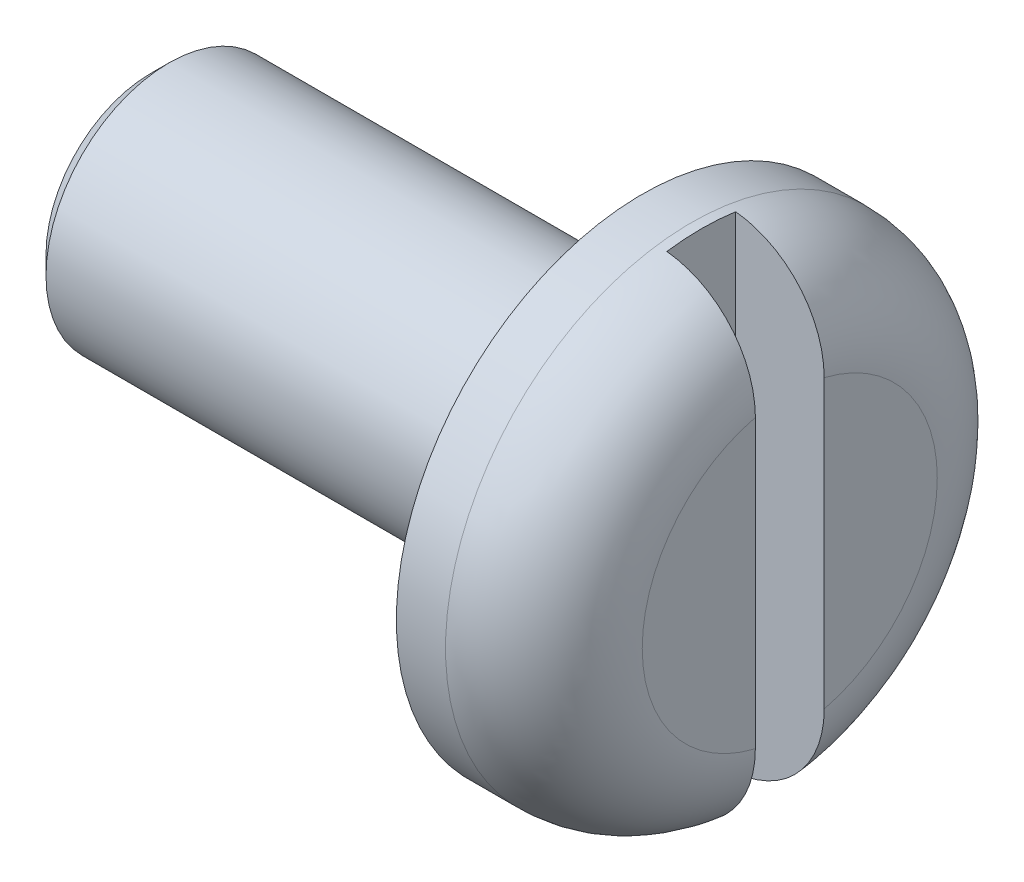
ISO-10303-21;
HEADER;
FILE_DESCRIPTION(('STEP AP214'),'2;1');
FILE_NAME('part.step','',(''),(''),'','','');
FILE_SCHEMA(('AUTOMOTIVE_DESIGN { 1 0 10303 214 1 1 1 1 }'));
ENDSEC;
DATA;
#1=APPLICATION_CONTEXT('core data for automotive mechanical design processes');
#2=APPLICATION_PROTOCOL_DEFINITION('international standard','automotive_design',2000,#1);
#3=PRODUCT_CONTEXT('',#1,'mechanical');
#4=PRODUCT('Part','Part','',(#3));
#5=PRODUCT_RELATED_PRODUCT_CATEGORY('part','',(#4));
#6=PRODUCT_DEFINITION_FORMATION('','',#4);
#7=PRODUCT_DEFINITION_CONTEXT('part definition',#1,'design');
#8=PRODUCT_DEFINITION('design','',#6,#7);
#9=PRODUCT_DEFINITION_SHAPE('','',#8);
#10=(LENGTH_UNIT() NAMED_UNIT(*) SI_UNIT(.MILLI.,.METRE.));
#11=(NAMED_UNIT(*) PLANE_ANGLE_UNIT() SI_UNIT($,.RADIAN.));
#12=(NAMED_UNIT(*) SI_UNIT($,.STERADIAN.) SOLID_ANGLE_UNIT());
#13=UNCERTAINTY_MEASURE_WITH_UNIT(LENGTH_MEASURE(1.E-05),#10,'distance_accuracy_value','');
#14=(GEOMETRIC_REPRESENTATION_CONTEXT(3) GLOBAL_UNCERTAINTY_ASSIGNED_CONTEXT((#13)) GLOBAL_UNIT_ASSIGNED_CONTEXT((#10,
#11,#12)) REPRESENTATION_CONTEXT('',''));
#15=CARTESIAN_POINT('',(0.,0.,0.));
#16=DIRECTION('',(0.,0.,1.));
#17=DIRECTION('',(1.,0.,0.));
#18=AXIS2_PLACEMENT_3D('',#15,#16,#17);
#19=CARTESIAN_POINT('',(-20.,0.,0.));
#20=DIRECTION('',(1.,0.,0.));
#21=DIRECTION('',(0.,0.,-1.));
#22=AXIS2_PLACEMENT_3D('',#19,#20,#21);
#23=CYLINDRICAL_SURFACE('',#22,5.);
#24=CARTESIAN_POINT('',(0.,0.,0.));
#25=DIRECTION('',(1.,0.,0.));
#26=DIRECTION('',(0.,0.,-1.));
#27=AXIS2_PLACEMENT_3D('',#24,#25,#26);
#28=CIRCLE('',#27,5.);
#29=CARTESIAN_POINT('',(0.,0.,-5.));
#30=VERTEX_POINT('',#29);
#31=EDGE_CURVE('E13',#30,#30,#28,.F.);
#32=ORIENTED_EDGE('',*,*,#31,.T.);
#33=EDGE_LOOP('',(#32));
#34=FACE_BOUND('',#33,.T.);
#35=CARTESIAN_POINT('',(-19.25,0.,0.));
#36=DIRECTION('',(1.,0.,0.));
#37=DIRECTION('',(0.,0.,-1.));
#38=AXIS2_PLACEMENT_3D('',#35,#36,#37);
#39=CIRCLE('',#38,5.);
#40=CARTESIAN_POINT('',(-19.25,0.,-5.));
#41=VERTEX_POINT('',#40);
#42=EDGE_CURVE('E229',#41,#41,#39,.F.);
#43=ORIENTED_EDGE('',*,*,#42,.F.);
#44=EDGE_LOOP('',(#43));
#45=FACE_BOUND('',#44,.T.);
#46=ADVANCED_FACE('F172',(#34,#45),#23,.T.);
#47=CARTESIAN_POINT('',(6.,0.,0.));
#48=DIRECTION('',(1.,0.,0.));
#49=DIRECTION('',(0.,0.,-1.));
#50=AXIS2_PLACEMENT_3D('',#47,#48,#49);
#51=PLANE('',#50);
#52=DIRECTION('',(0.,-1.,0.));
#53=VECTOR('',#52,1.);
#54=CARTESIAN_POINT('',(6.,11.1539479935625,1.4));
#55=LINE('',#54,#53);
#56=CARTESIAN_POINT('',(6.,5.83438085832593,1.4));
#57=VERTEX_POINT('',#56);
#58=CARTESIAN_POINT('',(6.,-5.83438085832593,1.4));
#59=VERTEX_POINT('',#58);
#60=EDGE_CURVE('E216',#57,#59,#55,.T.);
#61=ORIENTED_EDGE('',*,*,#60,.F.);
#62=CARTESIAN_POINT('',(6.,0.,0.));
#63=DIRECTION('',(1.,0.,0.));
#64=DIRECTION('',(0.,0.,-1.));
#65=AXIS2_PLACEMENT_3D('',#62,#63,#64);
#66=CIRCLE('',#65,6.);
#67=EDGE_CURVE('E227',#57,#59,#66,.T.);
#68=ORIENTED_EDGE('',*,*,#67,.T.);
#69=EDGE_LOOP('',(#61,#68));
#70=FACE_BOUND('',#69,.T.);
#71=ADVANCED_FACE('F226',(#70),#51,.T.);
#72=CARTESIAN_POINT('',(6.,0.,0.));
#73=DIRECTION('',(-1.,0.,0.));
#74=DIRECTION('',(0.,0.,1.));
#75=AXIS2_PLACEMENT_3D('',#72,#73,#74);
#76=CYLINDRICAL_SURFACE('',#75,10.);
#77=CARTESIAN_POINT('',(2.,0.,0.));
#78=DIRECTION('',(1.,0.,0.));
#79=DIRECTION('',(0.,0.,-1.));
#80=AXIS2_PLACEMENT_3D('',#77,#78,#79);
#81=CIRCLE('',#80,10.);
#82=CARTESIAN_POINT('',(2.,0.,-10.));
#83=VERTEX_POINT('',#82);
#84=EDGE_CURVE('E232',#83,#83,#81,.F.);
#85=ORIENTED_EDGE('',*,*,#84,.T.);
#86=EDGE_LOOP('',(#85));
#87=FACE_BOUND('',#86,.T.);
#88=CARTESIAN_POINT('',(0.,0.,0.));
#89=DIRECTION('',(1.,0.,0.));
#90=DIRECTION('',(0.,0.,-1.));
#91=AXIS2_PLACEMENT_3D('',#88,#89,#90);
#92=CIRCLE('',#91,10.);
#93=CARTESIAN_POINT('',(0.,0.,-10.));
#94=VERTEX_POINT('',#93);
#95=EDGE_CURVE('E239',#94,#94,#92,.T.);
#96=ORIENTED_EDGE('',*,*,#95,.T.);
#97=EDGE_LOOP('',(#96));
#98=FACE_BOUND('',#97,.T.);
#99=ADVANCED_FACE('F294',(#87,#98),#76,.T.);
#100=DIRECTION('',(0.,1.,0.));
#101=VECTOR('',#100,1.);
#102=CARTESIAN_POINT('',(6.,11.1539479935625,-1.4));
#103=LINE('',#102,#101);
#104=CARTESIAN_POINT('',(6.,-5.83438085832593,-1.4));
#105=VERTEX_POINT('',#104);
#106=CARTESIAN_POINT('',(6.,5.83438085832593,-1.4));
#107=VERTEX_POINT('',#106);
#108=EDGE_CURVE('E228',#105,#107,#103,.T.);
#109=ORIENTED_EDGE('',*,*,#108,.F.);
#110=EDGE_CURVE('E233',#105,#107,#66,.T.);
#111=ORIENTED_EDGE('',*,*,#110,.T.);
#112=EDGE_LOOP('',(#109,#111));
#113=FACE_BOUND('',#112,.T.);
#114=ADVANCED_FACE('F272',(#113),#51,.T.);
#115=CARTESIAN_POINT('',(0.,0.,0.));
#116=DIRECTION('',(1.,0.,0.));
#117=DIRECTION('',(0.,0.,-1.));
#118=AXIS2_PLACEMENT_3D('',#115,#116,#117);
#119=PLANE('',#118);
#120=ORIENTED_EDGE('',*,*,#31,.F.);
#121=EDGE_LOOP('',(#120));
#122=FACE_BOUND('',#121,.T.);
#123=ORIENTED_EDGE('',*,*,#95,.F.);
#124=EDGE_LOOP('',(#123));
#125=FACE_BOUND('',#124,.T.);
#126=ADVANCED_FACE('F325',(#122,#125),#119,.F.);
#127=CARTESIAN_POINT('',(2.,0.,0.));
#128=DIRECTION('',(1.,0.,0.));
#129=DIRECTION('',(0.,0.,-1.));
#130=AXIS2_PLACEMENT_3D('',#127,#128,#129);
#131=TOROIDAL_SURFACE('',#130,6.,4.);
#132=CARTESIAN_POINT('',(4.44187177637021,-9.06064172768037,1.4));
#133=CARTESIAN_POINT('',(4.26587430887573,-9.19788561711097,1.4));
#134=CARTESIAN_POINT('',(4.0781887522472,-9.32046512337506,1.4));
#135=CARTESIAN_POINT('',(3.68473930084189,-9.53251573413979,1.4));
#136=CARTESIAN_POINT('',(3.47895146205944,-9.62194214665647,1.4));
#137=CARTESIAN_POINT('',(3.05531205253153,-9.76488678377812,1.4));
#138=CARTESIAN_POINT('',(2.83746477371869,-9.81841769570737,1.4));
#139=CARTESIAN_POINT('',(2.3959323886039,-9.88800523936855,1.4));
#140=CARTESIAN_POINT('',(2.17224896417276,-9.90407254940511,1.4));
#141=CARTESIAN_POINT('',(1.72599843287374,-9.89830398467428,1.4));
#142=CARTESIAN_POINT('',(1.50342995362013,-9.87657400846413,1.4));
#143=CARTESIAN_POINT('',(1.06509554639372,-9.79605156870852,1.4));
#144=CARTESIAN_POINT('',(0.84932985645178,-9.73725780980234,1.4));
#145=CARTESIAN_POINT('',(0.430717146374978,-9.58433496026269,1.4));
#146=CARTESIAN_POINT('',(0.227869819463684,-9.4902067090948,1.4));
#147=CARTESIAN_POINT('',(-0.15922837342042,-9.26936689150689,1.4));
#148=CARTESIAN_POINT('',(-0.343479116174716,-9.14265510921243,1.4));
#149=CARTESIAN_POINT('',(-0.689029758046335,-8.8597278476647,1.4));
#150=CARTESIAN_POINT('',(-0.850229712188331,-8.7033903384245,1.4));
#151=CARTESIAN_POINT('',(-1.14437996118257,-8.36609286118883,1.4));
#152=CARTESIAN_POINT('',(-1.27732943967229,-8.18513218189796,1.4));
#153=CARTESIAN_POINT('',(-1.51261788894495,-7.80196170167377,1.4));
#154=CARTESIAN_POINT('',(-1.61465821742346,-7.59956860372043,1.4));
#155=CARTESIAN_POINT('',(-1.78392595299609,-7.18073257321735,1.4));
#156=CARTESIAN_POINT('',(-1.851151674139,-6.96428896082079,1.4));
#157=CARTESIAN_POINT('',(-1.95022439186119,-6.51965702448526,1.4));
#158=CARTESIAN_POINT('',(-1.98146031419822,-6.29133274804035,1.4));
#159=CARTESIAN_POINT('',(-2.00625779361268,-5.83266619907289,1.4));
#160=CARTESIAN_POINT('',(-1.99981460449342,-5.60232367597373,1.4));
#161=CARTESIAN_POINT('',(-1.9494549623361,-5.13920610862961,1.4));
#162=CARTESIAN_POINT('',(-1.90448529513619,-4.90654609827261,1.4));
#163=CARTESIAN_POINT('',(-1.77783498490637,-4.4515119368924,1.4));
#164=CARTESIAN_POINT('',(-1.6961526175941,-4.22913826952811,1.4));
#165=CARTESIAN_POINT('',(-1.49468677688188,-3.7901072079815,1.4));
#166=CARTESIAN_POINT('',(-1.37334388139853,-3.57416598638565,1.4));
#167=CARTESIAN_POINT('',(-1.09813237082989,-3.16404131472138,1.4));
#168=CARTESIAN_POINT('',(-0.944239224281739,-2.9698744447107,1.4));
#169=CARTESIAN_POINT('',(-0.597827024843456,-2.59615466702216,1.4));
#170=CARTESIAN_POINT('',(-0.403501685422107,-2.41826024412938,1.4));
#171=CARTESIAN_POINT('',(-0.092077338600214,-2.17758669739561,1.4));
#172=CARTESIAN_POINT('',(0.0151196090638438,-2.10168811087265,1.4));
#173=CARTESIAN_POINT('',(0.23574851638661,-1.95952195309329,1.4));
#174=CARTESIAN_POINT('',(0.349178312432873,-1.89325106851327,1.4));
#175=CARTESIAN_POINT('',(0.548659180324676,-1.7889672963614,1.4));
#176=CARTESIAN_POINT('',(0.63332024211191,-1.74827853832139,1.4));
#177=CARTESIAN_POINT('',(0.805407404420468,-1.67312945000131,1.4));
#178=CARTESIAN_POINT('',(0.892834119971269,-1.63867051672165,1.4));
#179=CARTESIAN_POINT('',(1.06991654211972,-1.57684435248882,1.4));
#180=CARTESIAN_POINT('',(1.15956573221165,-1.54945858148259,1.4));
#181=CARTESIAN_POINT('',(1.3408549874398,-1.50251309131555,1.4));
#182=CARTESIAN_POINT('',(1.43249386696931,-1.48294883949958,1.4));
#183=CARTESIAN_POINT('',(1.61825060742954,-1.4522400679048,1.4));
#184=CARTESIAN_POINT('',(1.71238475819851,-1.44119273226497,1.4));
#185=CARTESIAN_POINT('',(1.90128139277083,-1.42843400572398,1.4));
#186=CARTESIAN_POINT('',(1.99604381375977,-1.42672169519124,1.4));
#187=CARTESIAN_POINT('',(2.18534284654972,-1.432728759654,1.4));
#188=CARTESIAN_POINT('',(2.27987923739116,-1.44045516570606,1.4));
#189=CARTESIAN_POINT('',(2.46774805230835,-1.46493842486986,1.4));
#190=CARTESIAN_POINT('',(2.56108025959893,-1.48169688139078,1.4));
#191=CARTESIAN_POINT('',(2.85382362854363,-1.54796841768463,1.4));
#192=CARTESIAN_POINT('',(3.04990809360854,-1.61288226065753,1.4));
#193=CARTESIAN_POINT('',(3.33406189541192,-1.73299533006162,1.4));
#194=CARTESIAN_POINT('',(3.42727079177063,-1.77691954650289,1.4));
#195=CARTESIAN_POINT('',(3.61021636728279,-1.871573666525,1.4));
#196=CARTESIAN_POINT('',(3.69995278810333,-1.92230407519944,1.4));
#197=CARTESIAN_POINT('',(3.90017272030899,-2.04489804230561,1.4));
#198=CARTESIAN_POINT('',(4.00946392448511,-2.11870992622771,1.4));
#199=CARTESIAN_POINT('',(4.22139398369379,-2.2753050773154,1.4));
#200=CARTESIAN_POINT('',(4.32403139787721,-2.35809027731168,1.4));
#201=CARTESIAN_POINT('',(4.62096616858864,-2.61860205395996,1.4));
#202=CARTESIAN_POINT('',(4.80463515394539,-2.80870164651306,1.4));
#203=CARTESIAN_POINT('',(5.13874103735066,-3.21755005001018,1.4));
#204=CARTESIAN_POINT('',(5.28903783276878,-3.43641372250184,1.4));
#205=CARTESIAN_POINT('',(5.48466407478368,-3.78137683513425,1.4));
#206=CARTESIAN_POINT('',(5.54492425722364,-3.89920166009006,1.4));
#207=CARTESIAN_POINT('',(5.65490619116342,-4.13965275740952,1.4));
#208=CARTESIAN_POINT('',(5.70463228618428,-4.26227702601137,1.4));
#209=CARTESIAN_POINT('',(5.79220924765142,-4.50928577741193,1.4));
#210=CARTESIAN_POINT('',(5.83025200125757,-4.63360232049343,1.4));
#211=CARTESIAN_POINT('',(5.89514340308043,-4.88507488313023,1.4));
#212=CARTESIAN_POINT('',(5.92199682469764,-5.01222966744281,1.4));
#213=CARTESIAN_POINT('',(5.96415481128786,-5.26844608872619,1.4));
#214=CARTESIAN_POINT('',(5.97945909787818,-5.39750777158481,1.4));
#215=CARTESIAN_POINT('',(5.99824198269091,-5.65648556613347,1.4));
#216=CARTESIAN_POINT('',(6.00172152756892,-5.78640160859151,1.4));
#217=CARTESIAN_POINT('',(5.99684839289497,-6.03805873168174,1.4));
#218=CARTESIAN_POINT('',(5.98920621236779,-6.15981393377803,1.4));
#219=CARTESIAN_POINT('',(5.96331711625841,-6.40218796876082,1.4));
#220=CARTESIAN_POINT('',(5.94507095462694,-6.52280688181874,1.4));
#221=CARTESIAN_POINT('',(5.89801976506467,-6.76200813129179,1.4));
#222=CARTESIAN_POINT('',(5.86921144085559,-6.88058981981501,1.4));
#223=CARTESIAN_POINT('',(5.80119935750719,-7.11468294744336,1.4));
#224=CARTESIAN_POINT('',(5.76200002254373,-7.23019567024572,1.4));
#225=CARTESIAN_POINT('',(5.67525089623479,-7.45263639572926,1.4));
#226=CARTESIAN_POINT('',(5.6281059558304,-7.55972244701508,1.4));
#227=CARTESIAN_POINT('',(5.5247923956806,-7.7693959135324,1.4));
#228=CARTESIAN_POINT('',(5.46862760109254,-7.87198521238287,1.4));
#229=CARTESIAN_POINT('',(5.34771088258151,-8.07180138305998,1.4));
#230=CARTESIAN_POINT('',(5.28296963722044,-8.16903471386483,1.4));
#231=CARTESIAN_POINT('',(5.14532643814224,-8.35748732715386,1.4));
#232=CARTESIAN_POINT('',(5.07242724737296,-8.44870862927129,1.4));
#233=CARTESIAN_POINT('',(4.91198340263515,-8.63245739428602,1.4));
#234=CARTESIAN_POINT('',(4.82370993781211,-8.72435103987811,1.4));
#235=CARTESIAN_POINT('',(4.63884919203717,-8.89930077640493,1.4));
#236=CARTESIAN_POINT('',(4.54226192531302,-8.98235688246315,1.4));
#237=CARTESIAN_POINT('',(4.44187177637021,-9.06064172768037,1.4));
#238=B_SPLINE_CURVE_WITH_KNOTS('',3,(#132,#133,#134,#135,#136,#137,#138,#139,#140,#141,#142,
#143,#144,#145,#146,#147,#148,#149,#150,#151,#152,#153,#154,#155,#156,#157,#158,#159,#160,#161,
#162,#163,#164,#165,#166,#167,#168,#169,#170,#171,#172,#173,#174,#175,#176,#177,#178,#179,#180,
#181,#182,#183,#184,#185,#186,#187,#188,#189,#190,#191,#192,#193,#194,#195,#196,#197,#198,#199,
#200,#201,#202,#203,#204,#205,#206,#207,#208,#209,#210,#211,#212,#213,#214,#215,#216,#217,#218,
#219,#220,#221,#222,#223,#224,#225,#226,#227,#228,#229,#230,#231,#232,#233,#234,#235,#236,#237),
.UNSPECIFIED.,.T.,.F.,(4,2,2,2,2,2,2,2,2,2,2,2,2,2,2,2,2,2,2,2,2,2,2,2,2,2,2,2,2,2,2,2,2,2,2,2,
2,2,2,2,2,2,2,2,2,2,2,2,2,2,2,2,4),(0.,0.669105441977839,1.3391096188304,2.00887685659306,
2.67845316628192,3.34615651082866,4.01388319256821,4.68159401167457,5.3493092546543,
6.01983711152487,6.69038434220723,7.36721762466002,8.04408368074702,8.73228040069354,
9.42056381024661,10.1282863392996,10.8360421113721,11.5758836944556,12.3162848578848,
13.1027064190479,13.4963615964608,13.889880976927,14.1714629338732,14.4531079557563,
14.7340070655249,15.0147431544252,15.298637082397,15.5825030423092,15.866580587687,
16.1507085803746,16.7664463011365,17.0753898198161,17.384356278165,17.7794777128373,
18.1746844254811,18.9638801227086,19.7563288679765,20.1529254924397,20.5493582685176,
20.9388808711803,21.3282371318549,21.7176027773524,22.1069372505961,22.4724649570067,
22.8379666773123,23.2035825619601,23.5690430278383,23.9196275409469,24.2700637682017,
24.6200676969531,24.969953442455,25.351616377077,25.7332786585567),.UNSPECIFIED.);
#239=CARTESIAN_POINT('',(2.4,-9.88126494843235,1.4));
#240=VERTEX_POINT('',#239);
#241=EDGE_CURVE('E181',#59,#240,#238,.T.);
#242=ORIENTED_EDGE('',*,*,#241,.F.);
#243=ORIENTED_EDGE('',*,*,#67,.F.);
#244=CARTESIAN_POINT('',(2.71643912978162,1.51753697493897,1.4));
#245=CARTESIAN_POINT('',(2.57258810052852,1.48192838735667,1.4));
#246=CARTESIAN_POINT('',(2.42625150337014,1.45625343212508,1.4));
#247=CARTESIAN_POINT('',(2.20520382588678,1.43470004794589,1.4));
#248=CARTESIAN_POINT('',(2.13127260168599,1.43034162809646,1.4));
#249=CARTESIAN_POINT('',(1.98330271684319,1.42737857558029,1.4));
#250=CARTESIAN_POINT('',(1.90926408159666,1.42877275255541,1.4));
#251=CARTESIAN_POINT('',(1.7525531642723,1.43779670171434,1.4));
#252=CARTESIAN_POINT('',(1.66992254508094,1.44616204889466,1.4));
#253=CARTESIAN_POINT('',(1.5056657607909,1.46975091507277,1.4));
#254=CARTESIAN_POINT('',(1.42403969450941,1.48497510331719,1.4));
#255=CARTESIAN_POINT('',(1.18100193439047,1.54027095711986,1.4));
#256=CARTESIAN_POINT('',(1.02170255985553,1.58994756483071,1.4));
#257=CARTESIAN_POINT('',(0.756434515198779,1.69271032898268,1.4));
#258=CARTESIAN_POINT('',(0.648374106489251,1.74064884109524,1.4));
#259=CARTESIAN_POINT('',(0.436744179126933,1.84570179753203,1.4));
#260=CARTESIAN_POINT('',(0.333176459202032,1.90281987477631,1.4));
#261=CARTESIAN_POINT('',(0.130875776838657,2.02522875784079,1.4));
#262=CARTESIAN_POINT('',(0.0321475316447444,2.09052732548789,1.4));
#263=CARTESIAN_POINT('',(-0.159988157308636,2.22845633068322,1.4));
#264=CARTESIAN_POINT('',(-0.25339625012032,2.30108587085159,1.4));
#265=CARTESIAN_POINT('',(-0.52903379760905,2.5324210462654,1.4));
#266=CARTESIAN_POINT('',(-0.702377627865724,2.70194812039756,1.4));
#267=CARTESIAN_POINT('',(-1.0213106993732,3.06503434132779,1.4));
#268=CARTESIAN_POINT('',(-1.16691695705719,3.25857863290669,1.4));
#269=CARTESIAN_POINT('',(-1.44035389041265,3.6878425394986,1.4));
#270=CARTESIAN_POINT('',(-1.56461785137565,3.9258589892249,1.4));
#271=CARTESIAN_POINT('',(-1.76894969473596,4.42030041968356,1.4));
#272=CARTESIAN_POINT('',(-1.84900941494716,4.67672879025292,1.4));
#273=CARTESIAN_POINT('',(-1.95788537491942,5.18637041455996,1.4));
#274=CARTESIAN_POINT('',(-1.98914361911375,5.43906084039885,1.4));
#275=CARTESIAN_POINT('',(-2.00610343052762,5.94595598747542,1.4));
#276=CARTESIAN_POINT('',(-1.99182327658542,6.20016006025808,1.4));
#277=CARTESIAN_POINT('',(-1.91940113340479,6.68776313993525,1.4));
#278=CARTESIAN_POINT('',(-1.8637441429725,6.92153272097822,1.4));
#279=CARTESIAN_POINT('',(-1.71256898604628,7.37581542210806,1.4));
#280=CARTESIAN_POINT('',(-1.61705890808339,7.5963312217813,1.4));
#281=CARTESIAN_POINT('',(-1.3926483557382,8.00987085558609,1.4));
#282=CARTESIAN_POINT('',(-1.26500699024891,8.20357867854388,1.4));
#283=CARTESIAN_POINT('',(-0.978408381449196,8.56625107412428,1.4));
#284=CARTESIAN_POINT('',(-0.819454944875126,8.73521865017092,1.4));
#285=CARTESIAN_POINT('',(-0.478182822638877,9.04018861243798,1.4));
#286=CARTESIAN_POINT('',(-0.296383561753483,9.17677256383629,1.4));
#287=CARTESIAN_POINT('',(0.0877700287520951,9.41708398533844,1.4));
#288=CARTESIAN_POINT('',(0.290122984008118,9.52081365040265,1.4));
#289=CARTESIAN_POINT('',(0.707259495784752,9.69136066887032,1.4));
#290=CARTESIAN_POINT('',(0.921884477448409,9.75856606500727,1.4));
#291=CARTESIAN_POINT('',(1.35939830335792,9.85578285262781,1.4));
#292=CARTESIAN_POINT('',(1.5822868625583,9.88579552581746,1.4));
#293=CARTESIAN_POINT('',(2.02877738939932,9.9076804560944,1.4));
#294=CARTESIAN_POINT('',(2.2523698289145,9.89974761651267,1.4));
#295=CARTESIAN_POINT('',(2.69503967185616,9.84642376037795,1.4));
#296=CARTESIAN_POINT('',(2.91411713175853,9.80103321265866,1.4));
#297=CARTESIAN_POINT('',(3.34138139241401,9.67417742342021,1.4));
#298=CARTESIAN_POINT('',(3.54957627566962,9.59273939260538,1.4));
#299=CARTESIAN_POINT('',(3.94940049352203,9.39617954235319,1.4));
#300=CARTESIAN_POINT('',(4.14102973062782,9.2810575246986,1.4));
#301=CARTESIAN_POINT('',(4.50302006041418,9.020033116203,1.4));
#302=CARTESIAN_POINT('',(4.67330664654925,8.87402742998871,1.4));
#303=CARTESIAN_POINT('',(4.98719061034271,8.55571107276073,1.4));
#304=CARTESIAN_POINT('',(5.13078728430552,8.38339970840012,1.4));
#305=CARTESIAN_POINT('',(5.38856294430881,8.01588437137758,1.4));
#306=CARTESIAN_POINT('',(5.50248766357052,7.82050212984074,1.4));
#307=CARTESIAN_POINT('',(5.69646116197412,7.4136064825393,1.4));
#308=CARTESIAN_POINT('',(5.77650843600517,7.20209236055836,1.4));
#309=CARTESIAN_POINT('',(5.90187821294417,6.76554979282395,1.4));
#310=CARTESIAN_POINT('',(5.94665616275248,6.5403651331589,1.4));
#311=CARTESIAN_POINT('',(5.99877185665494,6.08572359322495,1.4));
#312=CARTESIAN_POINT('',(6.00610562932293,5.85626626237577,1.4));
#313=CARTESIAN_POINT('',(5.98352537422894,5.39329100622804,1.4));
#314=CARTESIAN_POINT('',(5.95264823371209,5.15982048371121,1.4));
#315=CARTESIAN_POINT('',(5.85373251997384,4.70094459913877,1.4));
#316=CARTESIAN_POINT('',(5.78569115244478,4.47553984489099,1.4));
#317=CARTESIAN_POINT('',(5.61159231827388,4.02903251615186,1.4));
#318=CARTESIAN_POINT('',(5.50406409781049,3.80850401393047,1.4));
#319=CARTESIAN_POINT('',(5.25554822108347,3.38717595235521,1.4));
#320=CARTESIAN_POINT('',(5.11454258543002,3.18638707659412,1.4));
#321=CARTESIAN_POINT('',(4.79386648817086,2.7973048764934,1.4));
#322=CARTESIAN_POINT('',(4.61237261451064,2.61050299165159,1.4));
#323=CARTESIAN_POINT('',(4.3194117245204,2.35433041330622,1.4));
#324=CARTESIAN_POINT('',(4.21823517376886,2.27290132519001,1.4));
#325=CARTESIAN_POINT('',(4.00942818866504,2.11875430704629,1.4));
#326=CARTESIAN_POINT('',(3.90179943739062,2.04603411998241,1.4));
#327=CARTESIAN_POINT('',(3.70772773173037,1.92696275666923,1.4));
#328=CARTESIAN_POINT('',(3.62256494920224,1.87851922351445,1.4));
#329=CARTESIAN_POINT('',(3.44904827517,1.78772929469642,1.4));
#330=CARTESIAN_POINT('',(3.36069371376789,1.74538418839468,1.4));
#331=CARTESIAN_POINT('',(3.09155347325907,1.62874058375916,1.4));
#332=CARTESIAN_POINT('',(2.90615797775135,1.56449958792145,1.4));
#333=CARTESIAN_POINT('',(2.71643912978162,1.51753697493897,1.4));
#334=B_SPLINE_CURVE_WITH_KNOTS('',3,(#244,#245,#246,#247,#248,#249,#250,#251,#252,#253,#254,
#255,#256,#257,#258,#259,#260,#261,#262,#263,#264,#265,#266,#267,#268,#269,#270,#271,#272,#273,
#274,#275,#276,#277,#278,#279,#280,#281,#282,#283,#284,#285,#286,#287,#288,#289,#290,#291,#292,
#293,#294,#295,#296,#297,#298,#299,#300,#301,#302,#303,#304,#305,#306,#307,#308,#309,#310,#311,
#312,#313,#314,#315,#316,#317,#318,#319,#320,#321,#322,#323,#324,#325,#326,#327,#328,#329,#330,
#331,#332,#333),.UNSPECIFIED.,.T.,.F.,(4,2,2,2,2,2,2,2,2,2,2,2,2,2,2,2,2,2,2,2,2,2,2,2,2,2,2,2,
2,2,2,2,2,2,2,2,2,2,2,2,2,2,2,2,4),(0.,0.444055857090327,0.666033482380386,0.887965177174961,
1.13680630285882,1.38567171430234,1.88421061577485,2.23846634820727,2.5928626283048,
2.94759775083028,3.30228950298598,4.02663150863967,4.75052770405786,5.55184648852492,
6.35331318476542,7.11321889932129,7.87281963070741,8.59015086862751,9.30733658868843,
9.99989677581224,10.6923728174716,11.3712669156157,12.050115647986,12.7216036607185,
13.3930685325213,14.0610882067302,14.7290995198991,15.3966074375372,16.0641192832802,
16.7339000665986,17.4036985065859,18.0790606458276,18.7544527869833,19.4400789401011,
20.1257778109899,20.8291173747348,21.5325098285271,22.2653163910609,22.9985174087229,
23.7760874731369,24.1653583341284,24.5545280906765,24.8482246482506,25.1419832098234,
25.727629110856),.UNSPECIFIED.);
#335=CARTESIAN_POINT('',(2.4,9.88126494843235,1.4));
#336=VERTEX_POINT('',#335);
#337=EDGE_CURVE('E213',#336,#57,#334,.T.);
#338=ORIENTED_EDGE('',*,*,#337,.F.);
#339=CARTESIAN_POINT('',(2.4,0.,0.));
#340=DIRECTION('',(-1.,0.,0.));
#341=DIRECTION('',(0.,0.,1.));
#342=AXIS2_PLACEMENT_3D('',#339,#340,#341);
#343=CIRCLE('',#342,9.97994974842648);
#344=CARTESIAN_POINT('',(2.4,9.88126494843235,-1.4));
#345=VERTEX_POINT('',#344);
#346=EDGE_CURVE('E236',#345,#336,#343,.F.);
#347=ORIENTED_EDGE('',*,*,#346,.F.);
#348=CARTESIAN_POINT('',(2.71643912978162,1.51753697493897,-1.4));
#349=CARTESIAN_POINT('',(2.9166688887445,1.56713753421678,-1.4));
#350=CARTESIAN_POINT('',(3.11235795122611,1.63601188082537,-1.4));
#351=CARTESIAN_POINT('',(3.39575447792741,1.76168559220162,-1.4));
#352=CARTESIAN_POINT('',(3.48873641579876,1.80743755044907,-1.4));
#353=CARTESIAN_POINT('',(3.67111957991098,1.9056540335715,-1.4));
#354=CARTESIAN_POINT('',(3.76052105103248,1.95811809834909,-1.4));
#355=CARTESIAN_POINT('',(3.95973653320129,2.0845090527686,-1.4));
#356=CARTESIAN_POINT('',(4.06833539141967,2.16035308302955,-1.4));
#357=CARTESIAN_POINT('',(4.278726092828,2.3209318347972,-1.4));
#358=CARTESIAN_POINT('',(4.38051625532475,2.4056687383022,-1.4));
#359=CARTESIAN_POINT('',(4.67465122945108,2.67197035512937,-1.4));
#360=CARTESIAN_POINT('',(4.85610968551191,2.86585020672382,-1.4));
#361=CARTESIAN_POINT('',(5.18470671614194,3.28166480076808,-1.4));
#362=CARTESIAN_POINT('',(5.33173814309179,3.50368390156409,-1.4));
#363=CARTESIAN_POINT('',(5.58533707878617,3.96980032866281,-1.4));
#364=CARTESIAN_POINT('',(5.69191807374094,4.21389026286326,-1.4));
#365=CARTESIAN_POINT('',(5.85779146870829,4.71108433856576,-1.4));
#366=CARTESIAN_POINT('',(5.91817236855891,4.96382415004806,-1.4));
#367=CARTESIAN_POINT('',(5.99265670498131,5.47608661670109,-1.4));
#368=CARTESIAN_POINT('',(6.00676928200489,5.73560792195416,-1.4));
#369=CARTESIAN_POINT('',(5.98777387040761,6.23715834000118,-1.4));
#370=CARTESIAN_POINT('',(5.95747300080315,6.47929522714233,-1.4));
#371=CARTESIAN_POINT('',(5.85488908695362,6.95450340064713,-1.4));
#372=CARTESIAN_POINT('',(5.78261813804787,7.18757727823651,-1.4));
#373=CARTESIAN_POINT('',(5.60159352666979,7.62806562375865,-1.4));
#374=CARTESIAN_POINT('',(5.49443602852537,7.83613700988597,-1.4));
#375=CARTESIAN_POINT('',(5.24590875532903,8.23073908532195,-1.4));
#376=CARTESIAN_POINT('',(5.1045436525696,8.41727271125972,-1.4));
#377=CARTESIAN_POINT('',(4.79528617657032,8.75896697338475,-1.4));
#378=CARTESIAN_POINT('',(4.62809070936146,8.9147587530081,-1.4));
#379=CARTESIAN_POINT('',(4.26961860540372,9.19560786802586,-1.4));
#380=CARTESIAN_POINT('',(4.07834393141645,9.3206677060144,-1.4));
#381=CARTESIAN_POINT('',(3.67987607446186,9.53484867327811,-1.4));
#382=CARTESIAN_POINT('',(3.47292458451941,9.62441966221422,-1.4));
#383=CARTESIAN_POINT('',(3.0468567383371,9.76728074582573,-1.4));
#384=CARTESIAN_POINT('',(2.82774090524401,9.82057239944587,-1.4));
#385=CARTESIAN_POINT('',(2.38514033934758,9.8890565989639,-1.4));
#386=CARTESIAN_POINT('',(2.16169463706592,9.90450162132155,-1.4));
#387=CARTESIAN_POINT('',(1.71539228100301,9.89757477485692,-1.4));
#388=CARTESIAN_POINT('',(1.4925356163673,9.87520360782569,-1.4));
#389=CARTESIAN_POINT('',(1.05420864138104,9.79338924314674,-1.4));
#390=CARTESIAN_POINT('',(0.838724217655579,9.73402160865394,-1.4));
#391=CARTESIAN_POINT('',(0.420752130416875,9.58002434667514,-1.4));
#392=CARTESIAN_POINT('',(0.218264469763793,9.48539471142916,-1.4));
#393=CARTESIAN_POINT('',(-0.168450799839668,9.26340358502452,-1.4));
#394=CARTESIAN_POINT('',(-0.352639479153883,9.1359742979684,-1.4));
#395=CARTESIAN_POINT('',(-0.697181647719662,8.85218984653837,-1.4));
#396=CARTESIAN_POINT('',(-0.857534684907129,8.69583413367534,-1.4));
#397=CARTESIAN_POINT('',(-1.15105383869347,8.35757688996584,-1.4));
#398=CARTESIAN_POINT('',(-1.28403224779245,8.17551253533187,-1.4));
#399=CARTESIAN_POINT('',(-1.51797071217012,7.79187374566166,-1.4));
#400=CARTESIAN_POINT('',(-1.6189293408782,7.59029844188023,-1.4));
#401=CARTESIAN_POINT('',(-1.78744482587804,7.17065716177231,-1.4));
#402=CARTESIAN_POINT('',(-1.85455925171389,6.95241365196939,-1.4));
#403=CARTESIAN_POINT('',(-1.95203548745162,6.50789416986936,-1.4));
#404=CARTESIAN_POINT('',(-1.98239548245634,6.28161780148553,-1.4));
#405=CARTESIAN_POINT('',(-2.0063917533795,5.8221778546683,-1.4));
#406=CARTESIAN_POINT('',(-1.999210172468,5.58897189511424,-1.4));
#407=CARTESIAN_POINT('',(-1.94719718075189,5.12680055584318,-1.4));
#408=CARTESIAN_POINT('',(-1.90235666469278,4.89783621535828,-1.4));
#409=CARTESIAN_POINT('',(-1.77479739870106,4.44172462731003,-1.4));
#410=CARTESIAN_POINT('',(-1.69075786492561,4.21494765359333,-1.4));
#411=CARTESIAN_POINT('',(-1.48779966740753,3.77774399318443,-1.4));
#412=CARTESIAN_POINT('',(-1.36889057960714,3.56731283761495,-1.4));
#413=CARTESIAN_POINT('',(-1.09280524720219,3.15633368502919,-1.4));
#414=CARTESIAN_POINT('',(-0.933891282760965,2.95695630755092,-1.4));
#415=CARTESIAN_POINT('',(-0.585987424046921,2.58531441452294,-1.4));
#416=CARTESIAN_POINT('',(-0.396920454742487,2.41312169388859,-1.4));
#417=CARTESIAN_POINT('',(-0.088958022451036,2.1752038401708,-1.4));
#418=CARTESIAN_POINT('',(0.0209330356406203,2.09758999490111,-1.4));
#419=CARTESIAN_POINT('',(0.247305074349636,1.95245560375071,-1.4));
#420=CARTESIAN_POINT('',(0.363788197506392,1.88493836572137,-1.4));
#421=CARTESIAN_POINT('',(0.602333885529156,1.76168870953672,-1.4));
#422=CARTESIAN_POINT('',(0.724375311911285,1.70591554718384,-1.4));
#423=CARTESIAN_POINT('',(0.973734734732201,1.60784995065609,-1.4));
#424=CARTESIAN_POINT('',(1.10104774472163,1.56554509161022,-1.4));
#425=CARTESIAN_POINT('',(1.31176738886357,1.50956710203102,-1.4));
#426=CARTESIAN_POINT('',(1.39391363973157,1.49109591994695,-1.4));
#427=CARTESIAN_POINT('',(1.55944033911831,1.4609925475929,-1.4));
#428=CARTESIAN_POINT('',(1.64282034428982,1.44935795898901,-1.4));
#429=CARTESIAN_POINT('',(1.81010316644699,1.43337900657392,-1.4));
#430=CARTESIAN_POINT('',(1.89400449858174,1.4290192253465,-1.4));
#431=CARTESIAN_POINT('',(2.06184121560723,1.42772277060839,-1.4));
#432=CARTESIAN_POINT('',(2.14577658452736,1.43078403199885,-1.4));
#433=CARTESIAN_POINT('',(2.31150874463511,1.44407429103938,-1.4));
#434=CARTESIAN_POINT('',(2.39331632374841,1.45416927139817,-1.4));
#435=CARTESIAN_POINT('',(2.55580366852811,1.48099733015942,-1.4));
#436=CARTESIAN_POINT('',(2.63648342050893,1.49773048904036,-1.4));
#437=CARTESIAN_POINT('',(2.71643912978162,1.51753697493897,-1.4));
#438=B_SPLINE_CURVE_WITH_KNOTS('',3,(#348,#349,#350,#351,#352,#353,#354,#355,#356,#357,#358,
#359,#360,#361,#362,#363,#364,#365,#366,#367,#368,#369,#370,#371,#372,#373,#374,#375,#376,#377,
#378,#379,#380,#381,#382,#383,#384,#385,#386,#387,#388,#389,#390,#391,#392,#393,#394,#395,#396,
#397,#398,#399,#400,#401,#402,#403,#404,#405,#406,#407,#408,#409,#410,#411,#412,#413,#414,#415,
#416,#417,#418,#419,#420,#421,#422,#423,#424,#425,#426,#427,#428,#429,#430,#431,#432,#433,#434,
#435,#436,#437),.UNSPECIFIED.,.T.,.F.,(4,2,2,2,2,2,2,2,2,2,2,2,2,2,2,2,2,2,2,2,2,2,2,2,2,2,2,2,
2,2,2,2,2,2,2,2,2,2,2,2,2,2,2,2,4),(0.,0.618511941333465,0.92922788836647,1.23992254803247,
1.63678346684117,2.03374199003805,2.82642932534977,3.62155189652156,4.41640913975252,
5.19190751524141,5.96725267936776,6.69565657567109,7.42385065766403,8.122551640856,
8.82115724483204,9.50344157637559,10.1856703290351,10.858950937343,11.5322026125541,
12.200950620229,12.8696862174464,13.5370604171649,14.2044347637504,14.8731997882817,
15.5419774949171,16.2151985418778,16.8884495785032,17.5702872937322,18.2521586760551,
18.9489459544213,19.6459017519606,20.3682554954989,21.0904110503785,21.8520768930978,
22.6157218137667,23.0188962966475,23.4222025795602,23.8240857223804,24.2255970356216,
24.4779401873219,24.7301947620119,24.9819140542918,25.2335633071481,25.4805443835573,
25.7275284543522),.UNSPECIFIED.);
#439=EDGE_CURVE('E222',#107,#345,#438,.T.);
#440=ORIENTED_EDGE('',*,*,#439,.F.);
#441=ORIENTED_EDGE('',*,*,#110,.F.);
#442=CARTESIAN_POINT('',(4.44187177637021,-9.06064172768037,-1.4));
#443=CARTESIAN_POINT('',(4.62042302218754,-8.92137520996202,-1.4));
#444=CARTESIAN_POINT('',(4.78727093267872,-8.76674808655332,-1.4));
#445=CARTESIAN_POINT('',(5.09267287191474,-8.43140903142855,-1.4));
#446=CARTESIAN_POINT('',(5.2311810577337,-8.25065563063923,-1.4));
#447=CARTESIAN_POINT('',(5.47581635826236,-7.86872122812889,-1.4));
#448=CARTESIAN_POINT('',(5.5819825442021,-7.66756526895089,-1.4));
#449=CARTESIAN_POINT('',(5.75944547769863,-7.25053096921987,-1.4));
#450=CARTESIAN_POINT('',(5.83075356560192,-7.03465744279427,-1.4));
#451=CARTESIAN_POINT('',(5.93770180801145,-6.59142074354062,-1.4));
#452=CARTESIAN_POINT('',(5.97288747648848,-6.36394808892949,-1.4));
#453=CARTESIAN_POINT('',(6.00564465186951,-5.90631790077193,-1.4));
#454=CARTESIAN_POINT('',(6.00320987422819,-5.67615992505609,-1.4));
#455=CARTESIAN_POINT('',(5.96092790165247,-5.21294104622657,-1.4));
#456=CARTESIAN_POINT('',(5.92005367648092,-4.97997437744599,-1.4));
#457=CARTESIAN_POINT('',(5.8014510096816,-4.5236807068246,-1.4));
#458=CARTESIAN_POINT('',(5.72371997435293,-4.30035438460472,-1.4));
#459=CARTESIAN_POINT('',(5.53017925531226,-3.85900377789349,-1.4));
#460=CARTESIAN_POINT('',(5.41283448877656,-3.64165324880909,-1.4));
#461=CARTESIAN_POINT('',(5.14534887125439,-3.2281355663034,-1.4));
#462=CARTESIAN_POINT('',(4.99518742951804,-3.03198182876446,-1.4));
#463=CARTESIAN_POINT('',(4.65621776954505,-2.65363630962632,-1.4));
#464=CARTESIAN_POINT('',(4.46559503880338,-2.47305585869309,-1.4));
#465=CARTESIAN_POINT('',(4.15948743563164,-2.22768384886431,-1.4));
#466=CARTESIAN_POINT('',(4.05401397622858,-2.15010071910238,-1.4));
#467=CARTESIAN_POINT('',(3.83676558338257,-2.0042773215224,-1.4));
#468=CARTESIAN_POINT('',(3.72499258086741,-1.93603421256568,-1.4));
#469=CARTESIAN_POINT('',(3.52642392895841,-1.82700799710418,-1.4));
#470=CARTESIAN_POINT('',(3.44096878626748,-1.78376878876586,-1.4));
#471=CARTESIAN_POINT('',(3.26711797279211,-1.7035608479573,-1.4));
#472=CARTESIAN_POINT('',(3.17872159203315,-1.66659364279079,-1.4));
#473=CARTESIAN_POINT('',(2.99950457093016,-1.59980630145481,-1.4));
#474=CARTESIAN_POINT('',(2.90869056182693,-1.56996848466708,-1.4));
#475=CARTESIAN_POINT('',(2.72486939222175,-1.51821493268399,-1.4));
#476=CARTESIAN_POINT('',(2.63186357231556,-1.49629448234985,-1.4));
#477=CARTESIAN_POINT('',(2.44303028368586,-1.46100008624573,-1.4));
#478=CARTESIAN_POINT('',(2.34718213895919,-1.44773527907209,-1.4));
#479=CARTESIAN_POINT('',(2.1546394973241,-1.43085548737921,-1.4));
#480=CARTESIAN_POINT('',(2.05794510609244,-1.42723931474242,-1.4));
#481=CARTESIAN_POINT('',(1.86465558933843,-1.42985633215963,-1.4));
#482=CARTESIAN_POINT('',(1.768060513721,-1.43609316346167,-1.4));
#483=CARTESIAN_POINT('',(1.57596021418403,-1.45808081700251,-1.4));
#484=CARTESIAN_POINT('',(1.48045517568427,-1.47383323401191,-1.4));
#485=CARTESIAN_POINT('',(1.28659162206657,-1.51510952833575,-1.4));
#486=CARTESIAN_POINT('',(1.18832981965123,-1.54108336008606,-1.4));
#487=CARTESIAN_POINT('',(0.994452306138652,-1.60164489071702,-1.4));
#488=CARTESIAN_POINT('',(0.898838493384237,-1.63623860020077,-1.4));
#489=CARTESIAN_POINT('',(0.710491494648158,-1.71310477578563,-1.4));
#490=CARTESIAN_POINT('',(0.617766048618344,-1.75539609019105,-1.4));
#491=CARTESIAN_POINT('',(0.435757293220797,-1.84672269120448,-1.4));
#492=CARTESIAN_POINT('',(0.346472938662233,-1.89575590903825,-1.4));
#493=CARTESIAN_POINT('',(0.146249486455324,-2.01496097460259,-1.4));
#494=CARTESIAN_POINT('',(0.0365042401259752,-2.08714779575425,-1.4));
#495=CARTESIAN_POINT('',(-0.176453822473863,-2.24054327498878,-1.4));
#496=CARTESIAN_POINT('',(-0.279665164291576,-2.32175395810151,-1.4));
#497=CARTESIAN_POINT('',(-0.578547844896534,-2.57761785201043,-1.4));
#498=CARTESIAN_POINT('',(-0.763813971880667,-2.76471223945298,-1.4));
#499=CARTESIAN_POINT('',(-1.10190541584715,-3.16773389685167,-1.4));
#500=CARTESIAN_POINT('',(-1.25456138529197,-3.38380262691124,-1.4));
#501=CARTESIAN_POINT('',(-1.52089465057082,-3.83883972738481,-1.4));
#502=CARTESIAN_POINT('',(-1.63458108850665,-4.0778027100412,-1.4));
#503=CARTESIAN_POINT('',(-1.81695391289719,-4.56902851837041,-1.4));
#504=CARTESIAN_POINT('',(-1.8861787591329,-4.82109062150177,-1.4));
#505=CARTESIAN_POINT('',(-1.97828519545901,-5.33359337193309,-1.4));
#506=CARTESIAN_POINT('',(-2.00117693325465,-5.59403217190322,-1.4));
#507=CARTESIAN_POINT('',(-1.99880386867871,-6.09870011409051,-1.4));
#508=CARTESIAN_POINT('',(-1.97640561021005,-6.34294406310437,-1.4));
#509=CARTESIAN_POINT('',(-1.88904229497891,-6.8236971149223,-1.4));
#510=CARTESIAN_POINT('',(-1.82408945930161,-7.06020841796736,-1.4));
#511=CARTESIAN_POINT('',(-1.65675090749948,-7.50813837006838,-1.4));
#512=CARTESIAN_POINT('',(-1.55607359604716,-7.72019628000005,-1.4));
#513=CARTESIAN_POINT('',(-1.31967931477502,-8.12379488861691,-1.4));
#514=CARTESIAN_POINT('',(-1.18396751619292,-8.31533860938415,-1.4));
#515=CARTESIAN_POINT('',(-0.88508176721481,-8.66755434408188,-1.4));
#516=CARTESIAN_POINT('',(-0.722666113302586,-8.82887026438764,-1.4));
#517=CARTESIAN_POINT('',(-0.372724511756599,-9.12147592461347,-1.4));
#518=CARTESIAN_POINT('',(-0.185200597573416,-9.25276809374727,-1.4));
#519=CARTESIAN_POINT('',(0.206801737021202,-9.4797566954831,-1.4));
#520=CARTESIAN_POINT('',(0.411009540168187,-9.57592069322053,-1.4));
#521=CARTESIAN_POINT('',(0.832739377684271,-9.73231178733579,-1.4));
#522=CARTESIAN_POINT('',(1.05026009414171,-9.79254243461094,-1.4));
#523=CARTESIAN_POINT('',(1.49073606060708,-9.87497581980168,-1.4));
#524=CARTESIAN_POINT('',(1.71363986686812,-9.89745372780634,-1.4));
#525=CARTESIAN_POINT('',(2.16012710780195,-9.90457045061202,-1.4));
#526=CARTESIAN_POINT('',(2.38371072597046,-9.88919793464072,-1.4));
#527=CARTESIAN_POINT('',(2.82466956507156,-9.82112690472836,-1.4));
#528=CARTESIAN_POINT('',(3.04205541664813,-9.76849687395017,-1.4));
#529=CARTESIAN_POINT('',(3.46468484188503,-9.62756373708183,-1.4));
#530=CARTESIAN_POINT('',(3.66994632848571,-9.53931484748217,-1.4));
#531=CARTESIAN_POINT('',(3.9673395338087,-9.38074527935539,-1.4));
#532=CARTESIAN_POINT('',(4.06607227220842,-9.32247539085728,-1.4));
#533=CARTESIAN_POINT('',(4.25815962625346,-9.19766212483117,-1.4));
#534=CARTESIAN_POINT('',(4.35151428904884,-9.13111881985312,-1.4));
#535=CARTESIAN_POINT('',(4.44187177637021,-9.06064172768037,-1.4));
#536=B_SPLINE_CURVE_WITH_KNOTS('',3,(#442,#443,#444,#445,#446,#447,#448,#449,#450,#451,#452,
#453,#454,#455,#456,#457,#458,#459,#460,#461,#462,#463,#464,#465,#466,#467,#468,#469,#470,#471,
#472,#473,#474,#475,#476,#477,#478,#479,#480,#481,#482,#483,#484,#485,#486,#487,#488,#489,#490,
#491,#492,#493,#494,#495,#496,#497,#498,#499,#500,#501,#502,#503,#504,#505,#506,#507,#508,#509,
#510,#511,#512,#513,#514,#515,#516,#517,#518,#519,#520,#521,#522,#523,#524,#525,#526,#527,#528,
#529,#530,#531,#532,#533,#534,#535),.UNSPECIFIED.,.T.,.F.,(4,2,2,2,2,2,2,2,2,2,2,2,2,2,2,2,2,2,
2,2,2,2,2,2,2,2,2,2,2,2,2,2,2,2,2,2,2,2,2,2,2,2,2,2,2,2,4),(0.,0.678894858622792,
1.35887937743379,2.03803914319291,2.71697781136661,3.4043577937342,4.09185260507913,
4.79825407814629,5.50470526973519,6.24246912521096,6.98069722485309,7.76453475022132,
8.15696542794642,8.54927646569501,8.836375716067,9.12354477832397,9.40999410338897,
9.69627255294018,9.9860942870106,10.2758803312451,10.565773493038,10.8557152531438,
11.1601810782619,11.4648598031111,11.7702948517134,12.0756363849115,12.4691701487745,
12.8627924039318,13.6488380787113,14.4388715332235,15.2287195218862,16.0088119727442,
16.7887335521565,17.5208361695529,18.2527286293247,18.9535124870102,19.6541929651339,
20.3376243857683,21.021000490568,21.694917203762,22.3687673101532,23.0376842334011,
23.7068014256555,24.3746918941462,25.0415695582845,25.385133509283,25.7286944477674),.UNSPECIFIED.);
#537=CARTESIAN_POINT('',(2.4,-9.88126494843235,-1.4));
#538=VERTEX_POINT('',#537);
#539=EDGE_CURVE('E261',#538,#105,#536,.T.);
#540=ORIENTED_EDGE('',*,*,#539,.F.);
#541=EDGE_CURVE('E193',#240,#538,#343,.F.);
#542=ORIENTED_EDGE('',*,*,#541,.F.);
#543=EDGE_LOOP('',(#242,#243,#338,#347,#440,#441,#540,#542));
#544=FACE_BOUND('',#543,.T.);
#545=ORIENTED_EDGE('',*,*,#84,.F.);
#546=EDGE_LOOP('',(#545));
#547=FACE_BOUND('',#546,.T.);
#548=ADVANCED_FACE('F174',(#544,#547),#131,.T.);
#549=CARTESIAN_POINT('',(2.4,11.1539479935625,1.4));
#550=DIRECTION('',(0.,0.,1.));
#551=DIRECTION('',(0.,-1.,0.));
#552=AXIS2_PLACEMENT_3D('',#549,#550,#551);
#553=PLANE('',#552);
#554=ORIENTED_EDGE('',*,*,#241,.T.);
#555=DIRECTION('',(0.,-1.,0.));
#556=VECTOR('',#555,1.);
#557=CARTESIAN_POINT('',(2.4,11.1539479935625,1.4));
#558=LINE('',#557,#556);
#559=EDGE_CURVE('E218',#336,#240,#558,.T.);
#560=ORIENTED_EDGE('',*,*,#559,.F.);
#561=ORIENTED_EDGE('',*,*,#337,.T.);
#562=ORIENTED_EDGE('',*,*,#60,.T.);
#563=EDGE_LOOP('',(#554,#560,#561,#562));
#564=FACE_BOUND('',#563,.T.);
#565=ADVANCED_FACE('F215',(#564),#553,.F.);
#566=CARTESIAN_POINT('',(2.4,11.1539479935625,-1.4));
#567=DIRECTION('',(0.,0.,-1.));
#568=DIRECTION('',(0.,1.,0.));
#569=AXIS2_PLACEMENT_3D('',#566,#567,#568);
#570=PLANE('',#569);
#571=ORIENTED_EDGE('',*,*,#539,.T.);
#572=ORIENTED_EDGE('',*,*,#108,.T.);
#573=ORIENTED_EDGE('',*,*,#439,.T.);
#574=DIRECTION('',(0.,1.,0.));
#575=VECTOR('',#574,1.);
#576=CARTESIAN_POINT('',(2.4,11.1539479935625,-1.4));
#577=LINE('',#576,#575);
#578=EDGE_CURVE('E188',#538,#345,#577,.T.);
#579=ORIENTED_EDGE('',*,*,#578,.F.);
#580=EDGE_LOOP('',(#571,#572,#573,#579));
#581=FACE_BOUND('',#580,.T.);
#582=ADVANCED_FACE('F251',(#581),#570,.F.);
#583=CARTESIAN_POINT('',(2.4,0.,0.));
#584=DIRECTION('',(-1.,0.,0.));
#585=DIRECTION('',(0.,0.,1.));
#586=AXIS2_PLACEMENT_3D('',#583,#584,#585);
#587=PLANE('',#586);
#588=ORIENTED_EDGE('',*,*,#541,.T.);
#589=ORIENTED_EDGE('',*,*,#578,.T.);
#590=ORIENTED_EDGE('',*,*,#346,.T.);
#591=ORIENTED_EDGE('',*,*,#559,.T.);
#592=EDGE_LOOP('',(#588,#589,#590,#591));
#593=FACE_BOUND('',#592,.T.);
#594=ADVANCED_FACE('F255',(#593),#587,.F.);
#595=CARTESIAN_POINT('',(-20.,0.,0.));
#596=DIRECTION('',(1.,0.,0.));
#597=DIRECTION('',(0.,0.,1.));
#598=AXIS2_PLACEMENT_3D('',#595,#596,#597);
#599=CONICAL_SURFACE('',#598,4.25,0.78539816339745);
#600=CARTESIAN_POINT('',(-20.,0.,0.));
#601=DIRECTION('',(-1.,0.,0.));
#602=DIRECTION('',(0.,0.,1.));
#603=AXIS2_PLACEMENT_3D('',#600,#601,#602);
#604=CIRCLE('',#603,4.25);
#605=CARTESIAN_POINT('',(-20.,0.,4.25));
#606=VERTEX_POINT('',#605);
#607=EDGE_CURVE('E277',#606,#606,#604,.T.);
#608=ORIENTED_EDGE('',*,*,#607,.F.);
#609=EDGE_LOOP('',(#608));
#610=FACE_BOUND('',#609,.T.);
#611=ORIENTED_EDGE('',*,*,#42,.T.);
#612=EDGE_LOOP('',(#611));
#613=FACE_BOUND('',#612,.T.);
#614=ADVANCED_FACE('F283',(#610,#613),#599,.T.);
#615=CARTESIAN_POINT('',(-20.,0.,0.));
#616=DIRECTION('',(-1.,0.,0.));
#617=DIRECTION('',(0.,0.,1.));
#618=AXIS2_PLACEMENT_3D('',#615,#616,#617);
#619=PLANE('',#618);
#620=ORIENTED_EDGE('',*,*,#607,.T.);
#621=EDGE_LOOP('',(#620));
#622=FACE_BOUND('',#621,.T.);
#623=ADVANCED_FACE('F281',(#622),#619,.T.);
#624=CLOSED_SHELL('',(#46,#71,#99,#114,#126,#548,#565,#582,#594,#614,#623));
#625=MANIFOLD_SOLID_BREP('B2',#624);
#626=ADVANCED_BREP_SHAPE_REPRESENTATION('',(#18,#625),#14);
#627=SHAPE_DEFINITION_REPRESENTATION(#9,#626);
ENDSEC;
END-ISO-10303-21;
